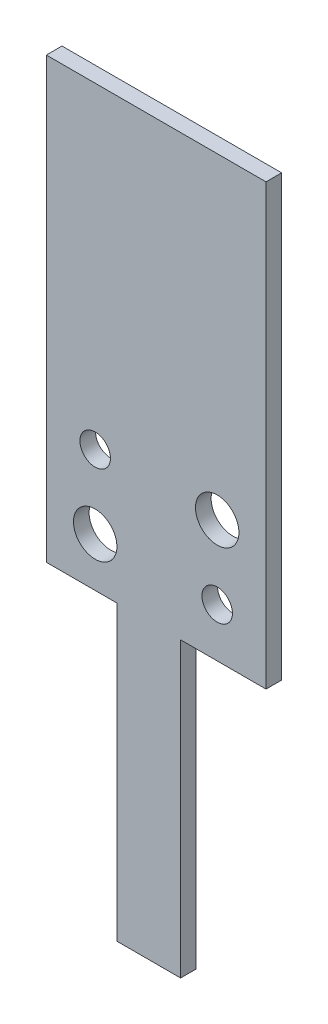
from build123d import *

# Parameters (mm, degrees)
SKETCH1_W                        = 11.43
SKETCH1_H                        = 38.1
EXTRUDE1_DEPTH                   = 0.8128
SKETCH2_W                        = 3.683
SKETCH2_H                        = 15.24
CUT_EXTRUDE1_DEPTH               = 37.087885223
SKETCH3_W                        = 4.445
SKETCH3_H                        = 15.24
CUT_EXTRUDE2_DEPTH               = 37.087885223
F_43_0_089000_DIAMETER_HOLE1_D   = 2.2606
F_1_16_0_062500_DIAMETER_HOLE1_D = 1.5875


with BuildPart() as part:
    # Sketch1 → Extrude1 (new body)
    with BuildSketch(Plane.XY):
        with Locations((0.381, 16.51)):
            Rectangle(SKETCH1_W, SKETCH1_H)
    extrude(amount=EXTRUDE1_DEPTH)

    # Sketch2 → Cut-Extrude1 (cut, through all)
    with BuildSketch(Plane.XY.offset(0.8128)):
        with Locations((-3.4925, 5.08)):
            Rectangle(SKETCH2_W, SKETCH2_H)
    extrude(amount=-CUT_EXTRUDE1_DEPTH, mode=Mode.SUBTRACT)

    # Sketch3 → Cut-Extrude2 (cut, through all)
    with BuildSketch(Plane.XY.offset(0.8128)):
        with Locations((3.8735, 5.08)):
            Rectangle(SKETCH3_W, SKETCH3_H)
    extrude(amount=-CUT_EXTRUDE2_DEPTH, mode=Mode.SUBTRACT)

    # 43 _0.089000_ Diameter Hole1 (through all)
    with Locations(Plane.XY.offset(0.8128)):
        with Locations((-2.794, 15.24), (3.556, 19.05)):
            Hole(F_43_0_089000_DIAMETER_HOLE1_D / 2)

    # 1_16 _0.062500_ Diameter Hole1 (through all)
    with Locations(Plane.XY.offset(0.8128)):
        with Locations((-2.794, 19.05), (3.556, 15.24)):
            Hole(F_1_16_0_062500_DIAMETER_HOLE1_D / 2)


solid = part.part
